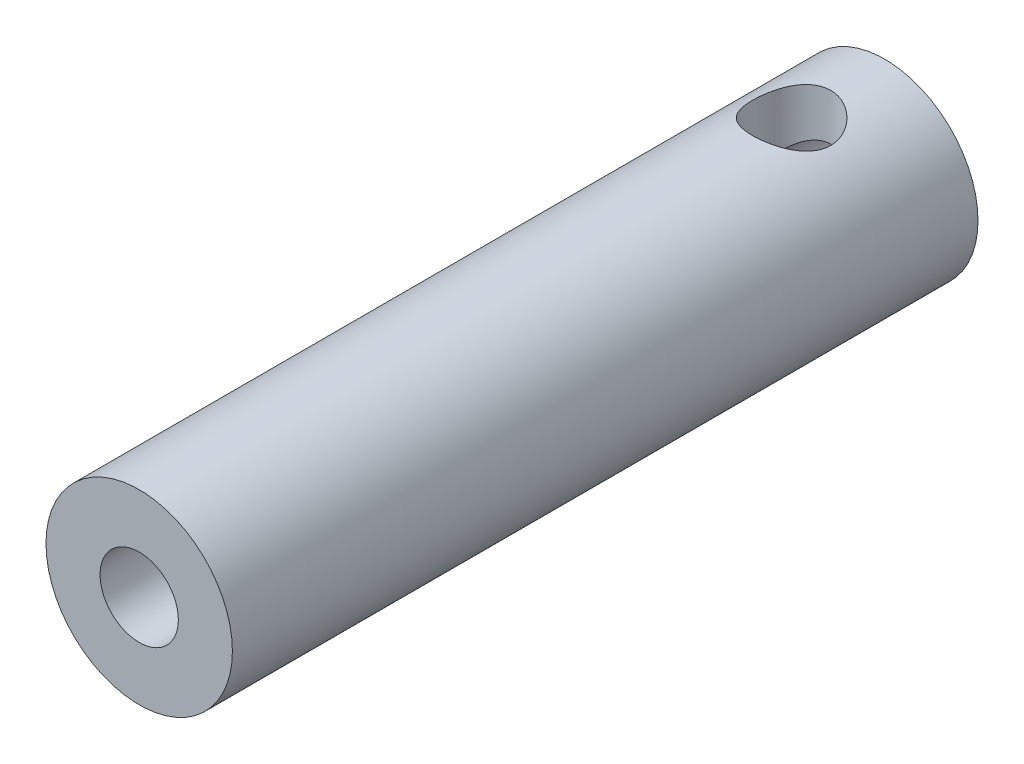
from build123d import *

# Parameters (mm, degrees)
SCHIZZO1_R                   = 5
ESTRUSIONE_ESTRUSIONE1_DEPTH = 40
FORO_FILETTATO_M5_1_D        = 4.2
FORO_FILETTATO_M5_1_DEPTH    = 15
FORO_FILETTATO_M5_1_TIP      = 1.2618073
FORO_5_0_5_1_D               = 5
FORO_5_0_5_1_DEPTH           = 13.497848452
FORO_5_0_5_1_TIP             = 1.502151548
FORO_FILETTATO_M5_2_REACH    = 43.533
FORO_FILETTATO_M5_2_BORE_R   = 2.1


with BuildPart() as part:
    # Schizzo1 → Estrusione-Estrusione1 (new body)
    with BuildSketch(Plane.XY):
        Circle(SCHIZZO1_R)
    extrude(amount=ESTRUSIONE_ESTRUSIONE1_DEPTH)

    # Foro filettato M5-1
    with Locations(Plane.XY.offset(40)):
        with Locations((0, 0)):
            Hole(FORO_FILETTATO_M5_1_D / 2, depth=FORO_FILETTATO_M5_1_DEPTH)
            with Locations((0, 0, -(FORO_FILETTATO_M5_1_DEPTH + FORO_FILETTATO_M5_1_TIP / 2))):  # 118° drill point
                Cone(0, FORO_FILETTATO_M5_1_D / 2, FORO_FILETTATO_M5_1_TIP, mode=Mode.SUBTRACT)

    # Foro _5.0 _5_-1
    with Locations(Plane(origin=(0, 0, 0), x_dir=(-1, 0, 0), z_dir=(0, 0, -1))):
        with Locations((0, 0)):
            Hole(FORO_5_0_5_1_D / 2, depth=FORO_5_0_5_1_DEPTH)
            with Locations((0, 0, -(FORO_5_0_5_1_DEPTH + FORO_5_0_5_1_TIP / 2))):  # 118° drill point
                Cone(0, FORO_5_0_5_1_D / 2, FORO_5_0_5_1_TIP, mode=Mode.SUBTRACT)

    # Foro filettato M5-2 bore → Foro filettato M5-2 (cut, up to next)
    with BuildSketch(Plane(origin=(0, 5, 0), x_dir=(1, 0, 0), z_dir=(0, 1, 0)), mode=Mode.PRIVATE) as foro_filettato_m5_2_sk1:
        with Locations((0, -5)):
            Circle(FORO_FILETTATO_M5_2_BORE_R)
    foro_filettato_m5_2_tool1 = extrude(foro_filettato_m5_2_sk1.sketch, amount=-FORO_FILETTATO_M5_2_REACH, mode=Mode.PRIVATE) & part.part
    add(foro_filettato_m5_2_tool1.solids().sort_by_distance((0, 5, 5))[0], mode=Mode.SUBTRACT)


solid = part.part
